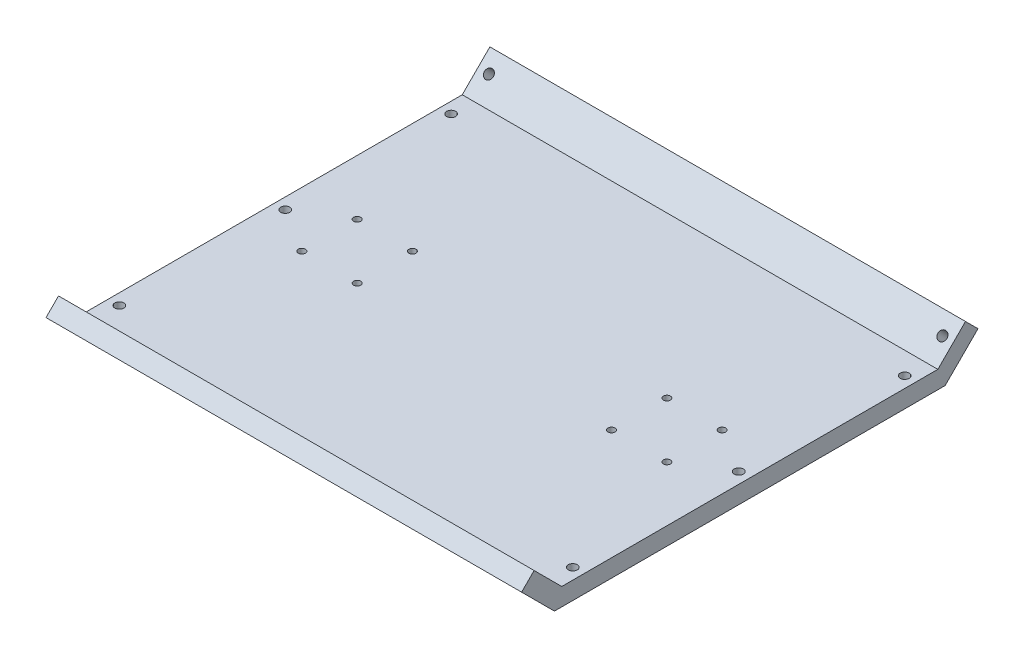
ISO-10303-21;
HEADER;
FILE_DESCRIPTION(('STEP AP214'),'2;1');
FILE_NAME('part.step','',(''),(''),'','','');
FILE_SCHEMA(('AUTOMOTIVE_DESIGN { 1 0 10303 214 1 1 1 1 }'));
ENDSEC;
DATA;
#1=APPLICATION_CONTEXT('core data for automotive mechanical design processes');
#2=APPLICATION_PROTOCOL_DEFINITION('international standard','automotive_design',2000,#1);
#3=PRODUCT_CONTEXT('',#1,'mechanical');
#4=PRODUCT('Part','Part','',(#3));
#5=PRODUCT_RELATED_PRODUCT_CATEGORY('part','',(#4));
#6=PRODUCT_DEFINITION_FORMATION('','',#4);
#7=PRODUCT_DEFINITION_CONTEXT('part definition',#1,'design');
#8=PRODUCT_DEFINITION('design','',#6,#7);
#9=PRODUCT_DEFINITION_SHAPE('','',#8);
#10=(LENGTH_UNIT() NAMED_UNIT(*) SI_UNIT(.MILLI.,.METRE.));
#11=(NAMED_UNIT(*) PLANE_ANGLE_UNIT() SI_UNIT($,.RADIAN.));
#12=(NAMED_UNIT(*) SI_UNIT($,.STERADIAN.) SOLID_ANGLE_UNIT());
#13=UNCERTAINTY_MEASURE_WITH_UNIT(LENGTH_MEASURE(1.E-05),#10,'distance_accuracy_value','');
#14=(GEOMETRIC_REPRESENTATION_CONTEXT(3) GLOBAL_UNCERTAINTY_ASSIGNED_CONTEXT((#13)) GLOBAL_UNIT_ASSIGNED_CONTEXT((#10,
#11,#12)) REPRESENTATION_CONTEXT('',''));
#15=CARTESIAN_POINT('',(0.,0.,0.));
#16=DIRECTION('',(0.,0.,1.));
#17=DIRECTION('',(1.,0.,0.));
#18=AXIS2_PLACEMENT_3D('',#15,#16,#17);
#19=CARTESIAN_POINT('',(107.5,6.84314575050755,103.156854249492));
#20=DIRECTION('',(0.,-0.707106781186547,-0.707106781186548));
#21=DIRECTION('',(0.,0.707106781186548,-0.707106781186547));
#22=AXIS2_PLACEMENT_3D('',#19,#20,#21);
#23=PLANE('',#22);
#24=DIRECTION('',(0.,-0.707106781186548,0.707106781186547));
#25=VECTOR('',#24,1.);
#26=CARTESIAN_POINT('',(-107.5,6.84314575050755,103.156854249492));
#27=LINE('',#26,#25);
#28=CARTESIAN_POINT('',(-107.5,12.4999999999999,97.5000000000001));
#29=VERTEX_POINT('',#28);
#30=CARTESIAN_POINT('',(-107.5,6.84314575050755,103.156854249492));
#31=VERTEX_POINT('',#30);
#32=EDGE_CURVE('E136',#29,#31,#27,.T.);
#33=ORIENTED_EDGE('',*,*,#32,.T.);
#34=DIRECTION('',(-1.,0.,0.));
#35=VECTOR('',#34,1.);
#36=CARTESIAN_POINT('',(107.5,6.84314575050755,103.156854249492));
#37=LINE('',#36,#35);
#38=CARTESIAN_POINT('',(107.5,6.84314575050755,103.156854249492));
#39=VERTEX_POINT('',#38);
#40=EDGE_CURVE('E11',#39,#31,#37,.T.);
#41=ORIENTED_EDGE('',*,*,#40,.F.);
#42=DIRECTION('',(0.,-0.707106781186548,0.707106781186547));
#43=VECTOR('',#42,1.);
#44=CARTESIAN_POINT('',(107.5,6.84314575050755,103.156854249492));
#45=LINE('',#44,#43);
#46=CARTESIAN_POINT('',(107.5,12.4999999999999,97.5000000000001));
#47=VERTEX_POINT('',#46);
#48=EDGE_CURVE('E151',#47,#39,#45,.T.);
#49=ORIENTED_EDGE('',*,*,#48,.F.);
#50=DIRECTION('',(-1.,0.,0.));
#51=VECTOR('',#50,1.);
#52=CARTESIAN_POINT('',(107.5,12.4999999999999,97.5000000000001));
#53=LINE('',#52,#51);
#54=EDGE_CURVE('E132',#47,#29,#53,.T.);
#55=ORIENTED_EDGE('',*,*,#54,.T.);
#56=EDGE_LOOP('',(#33,#41,#49,#55));
#57=FACE_BOUND('',#56,.T.);
#58=ADVANCED_FACE('F38',(#57),#23,.F.);
#59=CARTESIAN_POINT('',(107.5,-8.,88.313708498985));
#60=DIRECTION('',(0.,0.707106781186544,-0.707106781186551));
#61=DIRECTION('',(0.,0.707106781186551,0.707106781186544));
#62=AXIS2_PLACEMENT_3D('',#59,#60,#61);
#63=PLANE('',#62);
#64=CARTESIAN_POINT('',(-102.5,1.41421356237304,97.7279220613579));
#65=DIRECTION('',(0.,0.707106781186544,-0.707106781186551));
#66=DIRECTION('',(0.,0.707106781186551,0.707106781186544));
#67=AXIS2_PLACEMENT_3D('',#64,#65,#66);
#68=CIRCLE('',#67,2.04999999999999);
#69=CARTESIAN_POINT('',(-102.5,2.86378246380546,99.1774909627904));
#70=VERTEX_POINT('',#69);
#71=EDGE_CURVE('E229',#70,#70,#68,.T.);
#72=ORIENTED_EDGE('',*,*,#71,.T.);
#73=EDGE_LOOP('',(#72));
#74=FACE_BOUND('',#73,.T.);
#75=CARTESIAN_POINT('',(102.5,1.41421356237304,97.7279220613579));
#76=DIRECTION('',(0.,0.707106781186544,-0.707106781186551));
#77=DIRECTION('',(0.,0.707106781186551,0.707106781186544));
#78=AXIS2_PLACEMENT_3D('',#75,#76,#77);
#79=CIRCLE('',#78,2.04999999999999);
#80=CARTESIAN_POINT('',(102.5,2.86378246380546,99.1774909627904));
#81=VERTEX_POINT('',#80);
#82=EDGE_CURVE('E235',#81,#81,#79,.T.);
#83=ORIENTED_EDGE('',*,*,#82,.T.);
#84=EDGE_LOOP('',(#83));
#85=FACE_BOUND('',#84,.T.);
#86=DIRECTION('',(0.,-0.707106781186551,-0.707106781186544));
#87=VECTOR('',#86,1.);
#88=CARTESIAN_POINT('',(-107.5,-8.,88.313708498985));
#89=LINE('',#88,#87);
#90=CARTESIAN_POINT('',(-107.5,-8.,88.313708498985));
#91=VERTEX_POINT('',#90);
#92=EDGE_CURVE('E139',#31,#91,#89,.T.);
#93=ORIENTED_EDGE('',*,*,#92,.T.);
#94=DIRECTION('',(-1.,0.,0.));
#95=VECTOR('',#94,1.);
#96=CARTESIAN_POINT('',(107.5,-8.,88.313708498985));
#97=LINE('',#96,#95);
#98=CARTESIAN_POINT('',(107.5,-8.,88.313708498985));
#99=VERTEX_POINT('',#98);
#100=EDGE_CURVE('E47',#99,#91,#97,.T.);
#101=ORIENTED_EDGE('',*,*,#100,.F.);
#102=DIRECTION('',(0.,-0.707106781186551,-0.707106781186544));
#103=VECTOR('',#102,1.);
#104=CARTESIAN_POINT('',(107.5,-8.,88.313708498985));
#105=LINE('',#104,#103);
#106=EDGE_CURVE('E99',#39,#99,#105,.T.);
#107=ORIENTED_EDGE('',*,*,#106,.F.);
#108=ORIENTED_EDGE('',*,*,#40,.T.);
#109=EDGE_LOOP('',(#93,#101,#107,#108));
#110=FACE_BOUND('',#109,.T.);
#111=ADVANCED_FACE('F300',(#74,#85,#110),#63,.F.);
#112=CARTESIAN_POINT('',(107.5,-8.,88.313708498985));
#113=DIRECTION('',(0.,1.,0.));
#114=DIRECTION('',(0.,0.,1.));
#115=AXIS2_PLACEMENT_3D('',#112,#113,#114);
#116=PLANE('',#115);
#117=CARTESIAN_POINT('',(-57.5,-8.,-12.5));
#118=DIRECTION('',(0.,1.,0.));
#119=DIRECTION('',(0.,0.,-1.));
#120=AXIS2_PLACEMENT_3D('',#117,#118,#119);
#121=CIRCLE('',#120,1.59999999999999);
#122=CARTESIAN_POINT('',(-57.5,-8.,-14.1));
#123=VERTEX_POINT('',#122);
#124=EDGE_CURVE('E447',#123,#123,#121,.T.);
#125=ORIENTED_EDGE('',*,*,#124,.T.);
#126=EDGE_LOOP('',(#125));
#127=FACE_BOUND('',#126,.T.);
#128=CARTESIAN_POINT('',(-82.5,-8.,-12.5));
#129=DIRECTION('',(0.,1.,0.));
#130=DIRECTION('',(0.,0.,-1.));
#131=AXIS2_PLACEMENT_3D('',#128,#129,#130);
#132=CIRCLE('',#131,1.59999999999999);
#133=CARTESIAN_POINT('',(-82.5,-8.,-14.1));
#134=VERTEX_POINT('',#133);
#135=EDGE_CURVE('E442',#134,#134,#132,.T.);
#136=ORIENTED_EDGE('',*,*,#135,.T.);
#137=EDGE_LOOP('',(#136));
#138=FACE_BOUND('',#137,.T.);
#139=CARTESIAN_POINT('',(-82.5,-8.,12.5));
#140=DIRECTION('',(0.,1.,0.));
#141=DIRECTION('',(0.,0.,-1.));
#142=AXIS2_PLACEMENT_3D('',#139,#140,#141);
#143=CIRCLE('',#142,1.59999999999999);
#144=CARTESIAN_POINT('',(-82.5,-8.,10.9));
#145=VERTEX_POINT('',#144);
#146=EDGE_CURVE('E405',#145,#145,#143,.T.);
#147=ORIENTED_EDGE('',*,*,#146,.T.);
#148=EDGE_LOOP('',(#147));
#149=FACE_BOUND('',#148,.T.);
#150=CARTESIAN_POINT('',(-57.5,-8.,12.5));
#151=DIRECTION('',(0.,1.,0.));
#152=DIRECTION('',(0.,0.,-1.));
#153=AXIS2_PLACEMENT_3D('',#150,#151,#152);
#154=CIRCLE('',#153,1.59999999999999);
#155=CARTESIAN_POINT('',(-57.5,-8.,10.9));
#156=VERTEX_POINT('',#155);
#157=EDGE_CURVE('E181',#156,#156,#154,.T.);
#158=ORIENTED_EDGE('',*,*,#157,.T.);
#159=EDGE_LOOP('',(#158));
#160=FACE_BOUND('',#159,.T.);
#161=CARTESIAN_POINT('',(57.5,-8.,-12.5));
#162=DIRECTION('',(0.,-1.,0.));
#163=DIRECTION('',(0.,0.,-1.));
#164=AXIS2_PLACEMENT_3D('',#161,#162,#163);
#165=CIRCLE('',#164,1.59999999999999);
#166=CARTESIAN_POINT('',(57.5,-8.,-14.1));
#167=VERTEX_POINT('',#166);
#168=EDGE_CURVE('E188',#167,#167,#165,.T.);
#169=ORIENTED_EDGE('',*,*,#168,.F.);
#170=EDGE_LOOP('',(#169));
#171=FACE_BOUND('',#170,.T.);
#172=CARTESIAN_POINT('',(82.5,-8.,-12.5));
#173=DIRECTION('',(0.,-1.,0.));
#174=DIRECTION('',(0.,0.,-1.));
#175=AXIS2_PLACEMENT_3D('',#172,#173,#174);
#176=CIRCLE('',#175,1.59999999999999);
#177=CARTESIAN_POINT('',(82.5,-8.,-14.1));
#178=VERTEX_POINT('',#177);
#179=EDGE_CURVE('E192',#178,#178,#176,.T.);
#180=ORIENTED_EDGE('',*,*,#179,.F.);
#181=EDGE_LOOP('',(#180));
#182=FACE_BOUND('',#181,.T.);
#183=CARTESIAN_POINT('',(82.5,-8.,12.5));
#184=DIRECTION('',(0.,-1.,0.));
#185=DIRECTION('',(0.,0.,-1.));
#186=AXIS2_PLACEMENT_3D('',#183,#184,#185);
#187=CIRCLE('',#186,1.59999999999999);
#188=CARTESIAN_POINT('',(82.5,-8.,10.9));
#189=VERTEX_POINT('',#188);
#190=EDGE_CURVE('E197',#189,#189,#187,.T.);
#191=ORIENTED_EDGE('',*,*,#190,.F.);
#192=EDGE_LOOP('',(#191));
#193=FACE_BOUND('',#192,.T.);
#194=CARTESIAN_POINT('',(57.5,-8.,12.5));
#195=DIRECTION('',(0.,-1.,0.));
#196=DIRECTION('',(0.,0.,-1.));
#197=AXIS2_PLACEMENT_3D('',#194,#195,#196);
#198=CIRCLE('',#197,1.59999999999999);
#199=CARTESIAN_POINT('',(57.5,-8.,10.9));
#200=VERTEX_POINT('',#199);
#201=EDGE_CURVE('E167',#200,#200,#198,.T.);
#202=ORIENTED_EDGE('',*,*,#201,.F.);
#203=EDGE_LOOP('',(#202));
#204=FACE_BOUND('',#203,.T.);
#205=CARTESIAN_POINT('',(-102.5,-8.,-75.0000000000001));
#206=DIRECTION('',(0.,1.,0.));
#207=DIRECTION('',(0.,0.,1.));
#208=AXIS2_PLACEMENT_3D('',#205,#206,#207);
#209=CIRCLE('',#208,2.05);
#210=CARTESIAN_POINT('',(-102.5,-8.,-72.9500000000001));
#211=VERTEX_POINT('',#210);
#212=EDGE_CURVE('E211',#211,#211,#209,.T.);
#213=ORIENTED_EDGE('',*,*,#212,.T.);
#214=EDGE_LOOP('',(#213));
#215=FACE_BOUND('',#214,.T.);
#216=CARTESIAN_POINT('',(-102.5,-8.,0.));
#217=DIRECTION('',(0.,1.,0.));
#218=DIRECTION('',(0.,0.,1.));
#219=AXIS2_PLACEMENT_3D('',#216,#217,#218);
#220=CIRCLE('',#219,2.05);
#221=CARTESIAN_POINT('',(-102.5,-8.,2.05));
#222=VERTEX_POINT('',#221);
#223=EDGE_CURVE('E217',#222,#222,#220,.T.);
#224=ORIENTED_EDGE('',*,*,#223,.T.);
#225=EDGE_LOOP('',(#224));
#226=FACE_BOUND('',#225,.T.);
#227=CARTESIAN_POINT('',(-102.5,-8.,75.0000000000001));
#228=DIRECTION('',(0.,1.,0.));
#229=DIRECTION('',(0.,0.,1.));
#230=AXIS2_PLACEMENT_3D('',#227,#228,#229);
#231=CIRCLE('',#230,2.05);
#232=CARTESIAN_POINT('',(-102.5,-8.,77.0500000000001));
#233=VERTEX_POINT('',#232);
#234=EDGE_CURVE('E223',#233,#233,#231,.T.);
#235=ORIENTED_EDGE('',*,*,#234,.T.);
#236=EDGE_LOOP('',(#235));
#237=FACE_BOUND('',#236,.T.);
#238=CARTESIAN_POINT('',(102.5,-8.,75.0000000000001));
#239=DIRECTION('',(0.,1.,0.));
#240=DIRECTION('',(0.,0.,1.));
#241=AXIS2_PLACEMENT_3D('',#238,#239,#240);
#242=CIRCLE('',#241,2.05);
#243=CARTESIAN_POINT('',(102.5,-8.,77.0500000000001));
#244=VERTEX_POINT('',#243);
#245=EDGE_CURVE('E241',#244,#244,#242,.T.);
#246=ORIENTED_EDGE('',*,*,#245,.T.);
#247=EDGE_LOOP('',(#246));
#248=FACE_BOUND('',#247,.T.);
#249=CARTESIAN_POINT('',(102.5,-8.,0.));
#250=DIRECTION('',(0.,1.,0.));
#251=DIRECTION('',(0.,0.,1.));
#252=AXIS2_PLACEMENT_3D('',#249,#250,#251);
#253=CIRCLE('',#252,2.05);
#254=CARTESIAN_POINT('',(102.5,-8.,2.05));
#255=VERTEX_POINT('',#254);
#256=EDGE_CURVE('E247',#255,#255,#253,.T.);
#257=ORIENTED_EDGE('',*,*,#256,.T.);
#258=EDGE_LOOP('',(#257));
#259=FACE_BOUND('',#258,.T.);
#260=CARTESIAN_POINT('',(102.5,-8.,-75.0000000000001));
#261=DIRECTION('',(0.,1.,0.));
#262=DIRECTION('',(0.,0.,1.));
#263=AXIS2_PLACEMENT_3D('',#260,#261,#262);
#264=CIRCLE('',#263,2.05);
#265=CARTESIAN_POINT('',(102.5,-8.,-72.9500000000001));
#266=VERTEX_POINT('',#265);
#267=EDGE_CURVE('E253',#266,#266,#264,.T.);
#268=ORIENTED_EDGE('',*,*,#267,.T.);
#269=EDGE_LOOP('',(#268));
#270=FACE_BOUND('',#269,.T.);
#271=DIRECTION('',(0.,0.,-1.));
#272=VECTOR('',#271,1.);
#273=CARTESIAN_POINT('',(-107.5,-8.,88.313708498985));
#274=LINE('',#273,#272);
#275=CARTESIAN_POINT('',(-107.5,-8.,-88.3137084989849));
#276=VERTEX_POINT('',#275);
#277=EDGE_CURVE('E142',#91,#276,#274,.T.);
#278=ORIENTED_EDGE('',*,*,#277,.T.);
#279=DIRECTION('',(-1.,0.,0.));
#280=VECTOR('',#279,1.);
#281=CARTESIAN_POINT('',(107.5,-8.,-88.3137084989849));
#282=LINE('',#281,#280);
#283=CARTESIAN_POINT('',(107.5,-8.,-88.3137084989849));
#284=VERTEX_POINT('',#283);
#285=EDGE_CURVE('E158',#284,#276,#282,.T.);
#286=ORIENTED_EDGE('',*,*,#285,.F.);
#287=DIRECTION('',(0.,0.,-1.));
#288=VECTOR('',#287,1.);
#289=CARTESIAN_POINT('',(107.5,-8.,88.313708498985));
#290=LINE('',#289,#288);
#291=EDGE_CURVE('E263',#99,#284,#290,.T.);
#292=ORIENTED_EDGE('',*,*,#291,.F.);
#293=ORIENTED_EDGE('',*,*,#100,.T.);
#294=EDGE_LOOP('',(#278,#286,#292,#293));
#295=FACE_BOUND('',#294,.T.);
#296=ADVANCED_FACE('F305',(#127,#138,#149,#160,#171,#182,#193,#204,#215,#226,#237,#248,#259,
#270,#295),#116,.F.);
#297=CARTESIAN_POINT('',(107.5,-8.,-88.3137084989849));
#298=DIRECTION('',(0.,0.707106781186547,0.707106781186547));
#299=DIRECTION('',(0.,-0.707106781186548,0.707106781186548));
#300=AXIS2_PLACEMENT_3D('',#297,#298,#299);
#301=PLANE('',#300);
#302=CARTESIAN_POINT('',(-102.5,1.4142135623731,-97.727922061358));
#303=DIRECTION('',(0.,0.707106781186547,0.707106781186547));
#304=DIRECTION('',(0.,-0.707106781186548,0.707106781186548));
#305=AXIS2_PLACEMENT_3D('',#302,#303,#304);
#306=CIRCLE('',#305,2.04999999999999);
#307=CARTESIAN_POINT('',(-102.5,-0.0353553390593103,-96.2783531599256));
#308=VERTEX_POINT('',#307);
#309=EDGE_CURVE('E205',#308,#308,#306,.T.);
#310=ORIENTED_EDGE('',*,*,#309,.T.);
#311=EDGE_LOOP('',(#310));
#312=FACE_BOUND('',#311,.T.);
#313=CARTESIAN_POINT('',(102.5,1.4142135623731,-97.727922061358));
#314=DIRECTION('',(0.,0.707106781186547,0.707106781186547));
#315=DIRECTION('',(0.,-0.707106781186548,0.707106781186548));
#316=AXIS2_PLACEMENT_3D('',#313,#314,#315);
#317=CIRCLE('',#316,2.04999999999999);
#318=CARTESIAN_POINT('',(102.5,-0.0353553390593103,-96.2783531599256));
#319=VERTEX_POINT('',#318);
#320=EDGE_CURVE('E140',#319,#319,#317,.T.);
#321=ORIENTED_EDGE('',*,*,#320,.T.);
#322=EDGE_LOOP('',(#321));
#323=FACE_BOUND('',#322,.T.);
#324=DIRECTION('',(0.,0.707106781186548,-0.707106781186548));
#325=VECTOR('',#324,1.);
#326=CARTESIAN_POINT('',(-107.5,-8.,-88.3137084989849));
#327=LINE('',#326,#325);
#328=CARTESIAN_POINT('',(-107.5,6.84314575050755,-103.156854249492));
#329=VERTEX_POINT('',#328);
#330=EDGE_CURVE('E144',#276,#329,#327,.T.);
#331=ORIENTED_EDGE('',*,*,#330,.T.);
#332=DIRECTION('',(-1.,0.,0.));
#333=VECTOR('',#332,1.);
#334=CARTESIAN_POINT('',(107.5,6.84314575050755,-103.156854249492));
#335=LINE('',#334,#333);
#336=CARTESIAN_POINT('',(107.5,6.84314575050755,-103.156854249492));
#337=VERTEX_POINT('',#336);
#338=EDGE_CURVE('E155',#337,#329,#335,.T.);
#339=ORIENTED_EDGE('',*,*,#338,.F.);
#340=DIRECTION('',(0.,0.707106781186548,-0.707106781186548));
#341=VECTOR('',#340,1.);
#342=CARTESIAN_POINT('',(107.5,-8.,-88.3137084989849));
#343=LINE('',#342,#341);
#344=EDGE_CURVE('E265',#284,#337,#343,.T.);
#345=ORIENTED_EDGE('',*,*,#344,.F.);
#346=ORIENTED_EDGE('',*,*,#285,.T.);
#347=EDGE_LOOP('',(#331,#339,#345,#346));
#348=FACE_BOUND('',#347,.T.);
#349=ADVANCED_FACE('F271',(#312,#323,#348),#301,.F.);
#350=CARTESIAN_POINT('',(107.5,12.5,-97.5));
#351=DIRECTION('',(0.,-0.707106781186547,0.707106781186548));
#352=DIRECTION('',(0.,-0.707106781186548,-0.707106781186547));
#353=AXIS2_PLACEMENT_3D('',#350,#351,#352);
#354=PLANE('',#353);
#355=DIRECTION('',(0.,0.707106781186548,0.707106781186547));
#356=VECTOR('',#355,1.);
#357=CARTESIAN_POINT('',(-107.5,12.5,-97.5));
#358=LINE('',#357,#356);
#359=CARTESIAN_POINT('',(-107.5,12.5,-97.5));
#360=VERTEX_POINT('',#359);
#361=EDGE_CURVE('E146',#329,#360,#358,.T.);
#362=ORIENTED_EDGE('',*,*,#361,.T.);
#363=DIRECTION('',(-1.,0.,0.));
#364=VECTOR('',#363,1.);
#365=CARTESIAN_POINT('',(107.5,12.5,-97.5));
#366=LINE('',#365,#364);
#367=CARTESIAN_POINT('',(107.5,12.5,-97.5));
#368=VERTEX_POINT('',#367);
#369=EDGE_CURVE('E127',#368,#360,#366,.T.);
#370=ORIENTED_EDGE('',*,*,#369,.F.);
#371=DIRECTION('',(0.,0.707106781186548,0.707106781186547));
#372=VECTOR('',#371,1.);
#373=CARTESIAN_POINT('',(107.5,12.5,-97.5));
#374=LINE('',#373,#372);
#375=EDGE_CURVE('E118',#337,#368,#374,.T.);
#376=ORIENTED_EDGE('',*,*,#375,.F.);
#377=ORIENTED_EDGE('',*,*,#338,.T.);
#378=EDGE_LOOP('',(#362,#370,#376,#377));
#379=FACE_BOUND('',#378,.T.);
#380=ADVANCED_FACE('F275',(#379),#354,.F.);
#381=CARTESIAN_POINT('',(107.5,0.,-85.0000000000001));
#382=DIRECTION('',(0.,-0.707106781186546,-0.707106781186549));
#383=DIRECTION('',(0.,0.707106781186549,-0.707106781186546));
#384=AXIS2_PLACEMENT_3D('',#381,#382,#383);
#385=PLANE('',#384);
#386=CARTESIAN_POINT('',(-102.5,7.07106781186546,-92.0710678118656));
#387=DIRECTION('',(0.,0.707106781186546,0.707106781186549));
#388=DIRECTION('',(0.,-0.707106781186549,0.707106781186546));
#389=AXIS2_PLACEMENT_3D('',#386,#387,#388);
#390=CIRCLE('',#389,2.04999999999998);
#391=CARTESIAN_POINT('',(-102.5,5.62149891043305,-90.6214989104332));
#392=VERTEX_POINT('',#391);
#393=EDGE_CURVE('E176',#392,#392,#390,.T.);
#394=ORIENTED_EDGE('',*,*,#393,.F.);
#395=EDGE_LOOP('',(#394));
#396=FACE_BOUND('',#395,.T.);
#397=CARTESIAN_POINT('',(102.5,7.07106781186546,-92.0710678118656));
#398=DIRECTION('',(0.,0.707106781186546,0.707106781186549));
#399=DIRECTION('',(0.,-0.707106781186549,0.707106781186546));
#400=AXIS2_PLACEMENT_3D('',#397,#398,#399);
#401=CIRCLE('',#400,2.04999999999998);
#402=CARTESIAN_POINT('',(102.5,5.62149891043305,-90.6214989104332));
#403=VERTEX_POINT('',#402);
#404=EDGE_CURVE('E256',#403,#403,#401,.T.);
#405=ORIENTED_EDGE('',*,*,#404,.F.);
#406=EDGE_LOOP('',(#405));
#407=FACE_BOUND('',#406,.T.);
#408=DIRECTION('',(0.,-0.707106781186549,0.707106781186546));
#409=VECTOR('',#408,1.);
#410=CARTESIAN_POINT('',(-107.5,0.,-85.0000000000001));
#411=LINE('',#410,#409);
#412=CARTESIAN_POINT('',(-107.5,0.,-85.0000000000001));
#413=VERTEX_POINT('',#412);
#414=EDGE_CURVE('E126',#360,#413,#411,.T.);
#415=ORIENTED_EDGE('',*,*,#414,.T.);
#416=DIRECTION('',(-1.,0.,0.));
#417=VECTOR('',#416,1.);
#418=CARTESIAN_POINT('',(107.5,0.,-85.0000000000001));
#419=LINE('',#418,#417);
#420=CARTESIAN_POINT('',(107.5,0.,-85.0000000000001));
#421=VERTEX_POINT('',#420);
#422=EDGE_CURVE('E123',#421,#413,#419,.T.);
#423=ORIENTED_EDGE('',*,*,#422,.F.);
#424=DIRECTION('',(0.,-0.707106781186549,0.707106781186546));
#425=VECTOR('',#424,1.);
#426=CARTESIAN_POINT('',(107.5,0.,-85.0000000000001));
#427=LINE('',#426,#425);
#428=EDGE_CURVE('E112',#368,#421,#427,.T.);
#429=ORIENTED_EDGE('',*,*,#428,.F.);
#430=ORIENTED_EDGE('',*,*,#369,.T.);
#431=EDGE_LOOP('',(#415,#423,#429,#430));
#432=FACE_BOUND('',#431,.T.);
#433=ADVANCED_FACE('F124',(#396,#407,#432),#385,.F.);
#434=CARTESIAN_POINT('',(107.5,0.,85.0000000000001));
#435=DIRECTION('',(0.,-1.,0.));
#436=DIRECTION('',(0.,0.,-1.));
#437=AXIS2_PLACEMENT_3D('',#434,#435,#436);
#438=PLANE('',#437);
#439=CARTESIAN_POINT('',(-57.5,0.,-12.5));
#440=DIRECTION('',(0.,-1.,0.));
#441=DIRECTION('',(0.,0.,-1.));
#442=AXIS2_PLACEMENT_3D('',#439,#440,#441);
#443=CIRCLE('',#442,1.59999999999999);
#444=CARTESIAN_POINT('',(-57.5,0.,-14.1));
#445=VERTEX_POINT('',#444);
#446=EDGE_CURVE('E41',#445,#445,#443,.F.);
#447=ORIENTED_EDGE('',*,*,#446,.F.);
#448=EDGE_LOOP('',(#447));
#449=FACE_BOUND('',#448,.T.);
#450=CARTESIAN_POINT('',(-82.5,0.,-12.5));
#451=DIRECTION('',(0.,-1.,0.));
#452=DIRECTION('',(0.,0.,-1.));
#453=AXIS2_PLACEMENT_3D('',#450,#451,#452);
#454=CIRCLE('',#453,1.59999999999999);
#455=CARTESIAN_POINT('',(-82.5,0.,-14.1));
#456=VERTEX_POINT('',#455);
#457=EDGE_CURVE('E183',#456,#456,#454,.F.);
#458=ORIENTED_EDGE('',*,*,#457,.F.);
#459=EDGE_LOOP('',(#458));
#460=FACE_BOUND('',#459,.T.);
#461=CARTESIAN_POINT('',(-82.5,0.,12.5));
#462=DIRECTION('',(0.,-1.,0.));
#463=DIRECTION('',(0.,0.,-1.));
#464=AXIS2_PLACEMENT_3D('',#461,#462,#463);
#465=CIRCLE('',#464,1.59999999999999);
#466=CARTESIAN_POINT('',(-82.5,0.,10.9));
#467=VERTEX_POINT('',#466);
#468=EDGE_CURVE('E180',#467,#467,#465,.F.);
#469=ORIENTED_EDGE('',*,*,#468,.F.);
#470=EDGE_LOOP('',(#469));
#471=FACE_BOUND('',#470,.T.);
#472=CARTESIAN_POINT('',(-57.5,0.,12.5));
#473=DIRECTION('',(0.,-1.,0.));
#474=DIRECTION('',(0.,0.,-1.));
#475=AXIS2_PLACEMENT_3D('',#472,#473,#474);
#476=CIRCLE('',#475,1.59999999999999);
#477=CARTESIAN_POINT('',(-57.5,0.,10.9));
#478=VERTEX_POINT('',#477);
#479=EDGE_CURVE('E177',#478,#478,#476,.F.);
#480=ORIENTED_EDGE('',*,*,#479,.F.);
#481=EDGE_LOOP('',(#480));
#482=FACE_BOUND('',#481,.T.);
#483=CARTESIAN_POINT('',(57.5,0.,-12.5));
#484=DIRECTION('',(0.,-1.,0.));
#485=DIRECTION('',(0.,0.,-1.));
#486=AXIS2_PLACEMENT_3D('',#483,#484,#485);
#487=CIRCLE('',#486,1.59999999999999);
#488=CARTESIAN_POINT('',(57.5,0.,-14.1));
#489=VERTEX_POINT('',#488);
#490=EDGE_CURVE('E173',#489,#489,#487,.T.);
#491=ORIENTED_EDGE('',*,*,#490,.T.);
#492=EDGE_LOOP('',(#491));
#493=FACE_BOUND('',#492,.T.);
#494=CARTESIAN_POINT('',(82.5,0.,-12.5));
#495=DIRECTION('',(0.,-1.,0.));
#496=DIRECTION('',(0.,0.,-1.));
#497=AXIS2_PLACEMENT_3D('',#494,#495,#496);
#498=CIRCLE('',#497,1.59999999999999);
#499=CARTESIAN_POINT('',(82.5,0.,-14.1));
#500=VERTEX_POINT('',#499);
#501=EDGE_CURVE('E170',#500,#500,#498,.T.);
#502=ORIENTED_EDGE('',*,*,#501,.T.);
#503=EDGE_LOOP('',(#502));
#504=FACE_BOUND('',#503,.T.);
#505=CARTESIAN_POINT('',(82.5,0.,12.5));
#506=DIRECTION('',(0.,-1.,0.));
#507=DIRECTION('',(0.,0.,-1.));
#508=AXIS2_PLACEMENT_3D('',#505,#506,#507);
#509=CIRCLE('',#508,1.59999999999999);
#510=CARTESIAN_POINT('',(82.5,0.,10.9));
#511=VERTEX_POINT('',#510);
#512=EDGE_CURVE('E166',#511,#511,#509,.T.);
#513=ORIENTED_EDGE('',*,*,#512,.T.);
#514=EDGE_LOOP('',(#513));
#515=FACE_BOUND('',#514,.T.);
#516=CARTESIAN_POINT('',(57.5,0.,12.5));
#517=DIRECTION('',(0.,-1.,0.));
#518=DIRECTION('',(0.,0.,-1.));
#519=AXIS2_PLACEMENT_3D('',#516,#517,#518);
#520=CIRCLE('',#519,1.59999999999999);
#521=CARTESIAN_POINT('',(57.5,0.,10.9));
#522=VERTEX_POINT('',#521);
#523=EDGE_CURVE('E163',#522,#522,#520,.T.);
#524=ORIENTED_EDGE('',*,*,#523,.T.);
#525=EDGE_LOOP('',(#524));
#526=FACE_BOUND('',#525,.T.);
#527=CARTESIAN_POINT('',(-102.5,0.,-75.0000000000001));
#528=DIRECTION('',(0.,1.,0.));
#529=DIRECTION('',(0.,0.,1.));
#530=AXIS2_PLACEMENT_3D('',#527,#528,#529);
#531=CIRCLE('',#530,2.04999999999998);
#532=CARTESIAN_POINT('',(-102.5,0.,-72.9500000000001));
#533=VERTEX_POINT('',#532);
#534=EDGE_CURVE('E208',#533,#533,#531,.T.);
#535=ORIENTED_EDGE('',*,*,#534,.F.);
#536=EDGE_LOOP('',(#535));
#537=FACE_BOUND('',#536,.T.);
#538=CARTESIAN_POINT('',(-102.5,0.,0.));
#539=DIRECTION('',(0.,1.,0.));
#540=DIRECTION('',(0.,0.,1.));
#541=AXIS2_PLACEMENT_3D('',#538,#539,#540);
#542=CIRCLE('',#541,2.04999999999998);
#543=CARTESIAN_POINT('',(-102.5,0.,2.04999999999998));
#544=VERTEX_POINT('',#543);
#545=EDGE_CURVE('E214',#544,#544,#542,.T.);
#546=ORIENTED_EDGE('',*,*,#545,.F.);
#547=EDGE_LOOP('',(#546));
#548=FACE_BOUND('',#547,.T.);
#549=CARTESIAN_POINT('',(-102.5,0.,75.0000000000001));
#550=DIRECTION('',(0.,1.,0.));
#551=DIRECTION('',(0.,0.,1.));
#552=AXIS2_PLACEMENT_3D('',#549,#550,#551);
#553=CIRCLE('',#552,2.04999999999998);
#554=CARTESIAN_POINT('',(-102.5,0.,77.0500000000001));
#555=VERTEX_POINT('',#554);
#556=EDGE_CURVE('E220',#555,#555,#553,.T.);
#557=ORIENTED_EDGE('',*,*,#556,.F.);
#558=EDGE_LOOP('',(#557));
#559=FACE_BOUND('',#558,.T.);
#560=CARTESIAN_POINT('',(102.5,0.,75.0000000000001));
#561=DIRECTION('',(0.,1.,0.));
#562=DIRECTION('',(0.,0.,1.));
#563=AXIS2_PLACEMENT_3D('',#560,#561,#562);
#564=CIRCLE('',#563,2.04999999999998);
#565=CARTESIAN_POINT('',(102.5,0.,77.0500000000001));
#566=VERTEX_POINT('',#565);
#567=EDGE_CURVE('E238',#566,#566,#564,.T.);
#568=ORIENTED_EDGE('',*,*,#567,.F.);
#569=EDGE_LOOP('',(#568));
#570=FACE_BOUND('',#569,.T.);
#571=CARTESIAN_POINT('',(102.5,0.,0.));
#572=DIRECTION('',(0.,1.,0.));
#573=DIRECTION('',(0.,0.,1.));
#574=AXIS2_PLACEMENT_3D('',#571,#572,#573);
#575=CIRCLE('',#574,2.04999999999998);
#576=CARTESIAN_POINT('',(102.5,0.,2.04999999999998));
#577=VERTEX_POINT('',#576);
#578=EDGE_CURVE('E244',#577,#577,#575,.T.);
#579=ORIENTED_EDGE('',*,*,#578,.F.);
#580=EDGE_LOOP('',(#579));
#581=FACE_BOUND('',#580,.T.);
#582=CARTESIAN_POINT('',(102.5,0.,-75.0000000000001));
#583=DIRECTION('',(0.,1.,0.));
#584=DIRECTION('',(0.,0.,1.));
#585=AXIS2_PLACEMENT_3D('',#582,#583,#584);
#586=CIRCLE('',#585,2.04999999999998);
#587=CARTESIAN_POINT('',(102.5,0.,-72.9500000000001));
#588=VERTEX_POINT('',#587);
#589=EDGE_CURVE('E250',#588,#588,#586,.T.);
#590=ORIENTED_EDGE('',*,*,#589,.F.);
#591=EDGE_LOOP('',(#590));
#592=FACE_BOUND('',#591,.T.);
#593=DIRECTION('',(0.,0.,1.));
#594=VECTOR('',#593,1.);
#595=CARTESIAN_POINT('',(-107.5,0.,85.0000000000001));
#596=LINE('',#595,#594);
#597=CARTESIAN_POINT('',(-107.5,0.,85.0000000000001));
#598=VERTEX_POINT('',#597);
#599=EDGE_CURVE('E85',#413,#598,#596,.T.);
#600=ORIENTED_EDGE('',*,*,#599,.T.);
#601=DIRECTION('',(-1.,0.,0.));
#602=VECTOR('',#601,1.);
#603=CARTESIAN_POINT('',(107.5,0.,85.0000000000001));
#604=LINE('',#603,#602);
#605=CARTESIAN_POINT('',(107.5,0.,85.0000000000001));
#606=VERTEX_POINT('',#605);
#607=EDGE_CURVE('E128',#606,#598,#604,.T.);
#608=ORIENTED_EDGE('',*,*,#607,.F.);
#609=DIRECTION('',(0.,0.,1.));
#610=VECTOR('',#609,1.);
#611=CARTESIAN_POINT('',(107.5,0.,85.0000000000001));
#612=LINE('',#611,#610);
#613=EDGE_CURVE('E116',#421,#606,#612,.T.);
#614=ORIENTED_EDGE('',*,*,#613,.F.);
#615=ORIENTED_EDGE('',*,*,#422,.T.);
#616=EDGE_LOOP('',(#600,#608,#614,#615));
#617=FACE_BOUND('',#616,.T.);
#618=ADVANCED_FACE('F130',(#449,#460,#471,#482,#493,#504,#515,#526,#537,#548,#559,#570,#581,
#592,#617),#438,.F.);
#619=CARTESIAN_POINT('',(107.5,0.,85.0000000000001));
#620=DIRECTION('',(0.,-0.707106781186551,0.707106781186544));
#621=DIRECTION('',(0.,-0.707106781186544,-0.707106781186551));
#622=AXIS2_PLACEMENT_3D('',#619,#620,#621);
#623=PLANE('',#622);
#624=CARTESIAN_POINT('',(-102.5,7.07106781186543,92.0710678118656));
#625=DIRECTION('',(0.,0.707106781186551,-0.707106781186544));
#626=DIRECTION('',(0.,0.707106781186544,0.707106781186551));
#627=AXIS2_PLACEMENT_3D('',#624,#625,#626);
#628=CIRCLE('',#627,2.04999999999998);
#629=CARTESIAN_POINT('',(-102.5,8.52063671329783,93.520636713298));
#630=VERTEX_POINT('',#629);
#631=EDGE_CURVE('E226',#630,#630,#628,.T.);
#632=ORIENTED_EDGE('',*,*,#631,.F.);
#633=EDGE_LOOP('',(#632));
#634=FACE_BOUND('',#633,.T.);
#635=CARTESIAN_POINT('',(102.5,7.07106781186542,92.0710678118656));
#636=DIRECTION('',(0.,0.707106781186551,-0.707106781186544));
#637=DIRECTION('',(0.,0.707106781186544,0.707106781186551));
#638=AXIS2_PLACEMENT_3D('',#635,#636,#637);
#639=CIRCLE('',#638,2.04999999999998);
#640=CARTESIAN_POINT('',(102.5,8.52063671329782,93.520636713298));
#641=VERTEX_POINT('',#640);
#642=EDGE_CURVE('E232',#641,#641,#639,.T.);
#643=ORIENTED_EDGE('',*,*,#642,.F.);
#644=EDGE_LOOP('',(#643));
#645=FACE_BOUND('',#644,.T.);
#646=DIRECTION('',(0.,0.707106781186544,0.707106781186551));
#647=VECTOR('',#646,1.);
#648=CARTESIAN_POINT('',(-107.5,0.,85.0000000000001));
#649=LINE('',#648,#647);
#650=EDGE_CURVE('E91',#598,#29,#649,.T.);
#651=ORIENTED_EDGE('',*,*,#650,.T.);
#652=ORIENTED_EDGE('',*,*,#54,.F.);
#653=DIRECTION('',(0.,0.707106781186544,0.707106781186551));
#654=VECTOR('',#653,1.);
#655=CARTESIAN_POINT('',(107.5,0.,85.0000000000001));
#656=LINE('',#655,#654);
#657=EDGE_CURVE('E56',#606,#47,#656,.T.);
#658=ORIENTED_EDGE('',*,*,#657,.F.);
#659=ORIENTED_EDGE('',*,*,#607,.T.);
#660=EDGE_LOOP('',(#651,#652,#658,#659));
#661=FACE_BOUND('',#660,.T.);
#662=ADVANCED_FACE('F283',(#634,#645,#661),#623,.F.);
#663=CARTESIAN_POINT('',(107.5,0.,0.));
#664=DIRECTION('',(1.,0.,0.));
#665=DIRECTION('',(0.,0.,-1.));
#666=AXIS2_PLACEMENT_3D('',#663,#664,#665);
#667=PLANE('',#666);
#668=ORIENTED_EDGE('',*,*,#48,.T.);
#669=ORIENTED_EDGE('',*,*,#106,.T.);
#670=ORIENTED_EDGE('',*,*,#291,.T.);
#671=ORIENTED_EDGE('',*,*,#344,.T.);
#672=ORIENTED_EDGE('',*,*,#375,.T.);
#673=ORIENTED_EDGE('',*,*,#428,.T.);
#674=ORIENTED_EDGE('',*,*,#613,.T.);
#675=ORIENTED_EDGE('',*,*,#657,.T.);
#676=EDGE_LOOP('',(#668,#669,#670,#671,#672,#673,#674,#675));
#677=FACE_BOUND('',#676,.T.);
#678=ADVANCED_FACE('F114',(#677),#667,.T.);
#679=CARTESIAN_POINT('',(-107.5,0.,0.));
#680=DIRECTION('',(1.,0.,0.));
#681=DIRECTION('',(0.,0.,-1.));
#682=AXIS2_PLACEMENT_3D('',#679,#680,#681);
#683=PLANE('',#682);
#684=ORIENTED_EDGE('',*,*,#32,.F.);
#685=ORIENTED_EDGE('',*,*,#650,.F.);
#686=ORIENTED_EDGE('',*,*,#599,.F.);
#687=ORIENTED_EDGE('',*,*,#414,.F.);
#688=ORIENTED_EDGE('',*,*,#361,.F.);
#689=ORIENTED_EDGE('',*,*,#330,.F.);
#690=ORIENTED_EDGE('',*,*,#277,.F.);
#691=ORIENTED_EDGE('',*,*,#92,.F.);
#692=EDGE_LOOP('',(#684,#685,#686,#687,#688,#689,#690,#691));
#693=FACE_BOUND('',#692,.T.);
#694=ADVANCED_FACE('F278',(#693),#683,.F.);
#695=CARTESIAN_POINT('',(102.5,7.07106781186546,-92.0710678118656));
#696=DIRECTION('',(0.,0.707106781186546,0.707106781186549));
#697=DIRECTION('',(0.,-0.707106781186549,0.707106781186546));
#698=AXIS2_PLACEMENT_3D('',#695,#696,#697);
#699=CYLINDRICAL_SURFACE('',#698,2.04999999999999);
#700=ORIENTED_EDGE('',*,*,#404,.T.);
#701=EDGE_LOOP('',(#700));
#702=FACE_BOUND('',#701,.T.);
#703=ORIENTED_EDGE('',*,*,#320,.F.);
#704=EDGE_LOOP('',(#703));
#705=FACE_BOUND('',#704,.T.);
#706=ADVANCED_FACE('F326',(#702,#705),#699,.F.);
#707=CARTESIAN_POINT('',(102.5,0.,-75.0000000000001));
#708=DIRECTION('',(0.,1.,0.));
#709=DIRECTION('',(0.,0.,1.));
#710=AXIS2_PLACEMENT_3D('',#707,#708,#709);
#711=CYLINDRICAL_SURFACE('',#710,2.04999999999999);
#712=ORIENTED_EDGE('',*,*,#267,.F.);
#713=EDGE_LOOP('',(#712));
#714=FACE_BOUND('',#713,.T.);
#715=ORIENTED_EDGE('',*,*,#589,.T.);
#716=EDGE_LOOP('',(#715));
#717=FACE_BOUND('',#716,.T.);
#718=ADVANCED_FACE('F328',(#714,#717),#711,.F.);
#719=CARTESIAN_POINT('',(102.5,0.,0.));
#720=DIRECTION('',(0.,1.,0.));
#721=DIRECTION('',(0.,0.,1.));
#722=AXIS2_PLACEMENT_3D('',#719,#720,#721);
#723=CYLINDRICAL_SURFACE('',#722,2.04999999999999);
#724=ORIENTED_EDGE('',*,*,#256,.F.);
#725=EDGE_LOOP('',(#724));
#726=FACE_BOUND('',#725,.T.);
#727=ORIENTED_EDGE('',*,*,#578,.T.);
#728=EDGE_LOOP('',(#727));
#729=FACE_BOUND('',#728,.T.);
#730=ADVANCED_FACE('F335',(#726,#729),#723,.F.);
#731=CARTESIAN_POINT('',(102.5,0.,75.0000000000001));
#732=DIRECTION('',(0.,1.,0.));
#733=DIRECTION('',(0.,0.,1.));
#734=AXIS2_PLACEMENT_3D('',#731,#732,#733);
#735=CYLINDRICAL_SURFACE('',#734,2.04999999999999);
#736=ORIENTED_EDGE('',*,*,#245,.F.);
#737=EDGE_LOOP('',(#736));
#738=FACE_BOUND('',#737,.T.);
#739=ORIENTED_EDGE('',*,*,#567,.T.);
#740=EDGE_LOOP('',(#739));
#741=FACE_BOUND('',#740,.T.);
#742=ADVANCED_FACE('F341',(#738,#741),#735,.F.);
#743=CARTESIAN_POINT('',(102.5,7.07106781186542,92.0710678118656));
#744=DIRECTION('',(0.,0.707106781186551,-0.707106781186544));
#745=DIRECTION('',(0.,0.707106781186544,0.707106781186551));
#746=AXIS2_PLACEMENT_3D('',#743,#744,#745);
#747=CYLINDRICAL_SURFACE('',#746,2.04999999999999);
#748=ORIENTED_EDGE('',*,*,#642,.T.);
#749=EDGE_LOOP('',(#748));
#750=FACE_BOUND('',#749,.T.);
#751=ORIENTED_EDGE('',*,*,#82,.F.);
#752=EDGE_LOOP('',(#751));
#753=FACE_BOUND('',#752,.T.);
#754=ADVANCED_FACE('F345',(#750,#753),#747,.F.);
#755=CARTESIAN_POINT('',(-102.5,7.07106781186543,92.0710678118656));
#756=DIRECTION('',(0.,0.707106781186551,-0.707106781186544));
#757=DIRECTION('',(0.,0.707106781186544,0.707106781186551));
#758=AXIS2_PLACEMENT_3D('',#755,#756,#757);
#759=CYLINDRICAL_SURFACE('',#758,2.04999999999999);
#760=ORIENTED_EDGE('',*,*,#631,.T.);
#761=EDGE_LOOP('',(#760));
#762=FACE_BOUND('',#761,.T.);
#763=ORIENTED_EDGE('',*,*,#71,.F.);
#764=EDGE_LOOP('',(#763));
#765=FACE_BOUND('',#764,.T.);
#766=ADVANCED_FACE('F349',(#762,#765),#759,.F.);
#767=CARTESIAN_POINT('',(-102.5,0.,75.0000000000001));
#768=DIRECTION('',(0.,1.,0.));
#769=DIRECTION('',(0.,0.,1.));
#770=AXIS2_PLACEMENT_3D('',#767,#768,#769);
#771=CYLINDRICAL_SURFACE('',#770,2.04999999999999);
#772=ORIENTED_EDGE('',*,*,#234,.F.);
#773=EDGE_LOOP('',(#772));
#774=FACE_BOUND('',#773,.T.);
#775=ORIENTED_EDGE('',*,*,#556,.T.);
#776=EDGE_LOOP('',(#775));
#777=FACE_BOUND('',#776,.T.);
#778=ADVANCED_FACE('F353',(#774,#777),#771,.F.);
#779=CARTESIAN_POINT('',(-102.5,0.,0.));
#780=DIRECTION('',(0.,1.,0.));
#781=DIRECTION('',(0.,0.,1.));
#782=AXIS2_PLACEMENT_3D('',#779,#780,#781);
#783=CYLINDRICAL_SURFACE('',#782,2.04999999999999);
#784=ORIENTED_EDGE('',*,*,#223,.F.);
#785=EDGE_LOOP('',(#784));
#786=FACE_BOUND('',#785,.T.);
#787=ORIENTED_EDGE('',*,*,#545,.T.);
#788=EDGE_LOOP('',(#787));
#789=FACE_BOUND('',#788,.T.);
#790=ADVANCED_FACE('F357',(#786,#789),#783,.F.);
#791=CARTESIAN_POINT('',(-102.5,0.,-75.0000000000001));
#792=DIRECTION('',(0.,1.,0.));
#793=DIRECTION('',(0.,0.,1.));
#794=AXIS2_PLACEMENT_3D('',#791,#792,#793);
#795=CYLINDRICAL_SURFACE('',#794,2.04999999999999);
#796=ORIENTED_EDGE('',*,*,#212,.F.);
#797=EDGE_LOOP('',(#796));
#798=FACE_BOUND('',#797,.T.);
#799=ORIENTED_EDGE('',*,*,#534,.T.);
#800=EDGE_LOOP('',(#799));
#801=FACE_BOUND('',#800,.T.);
#802=ADVANCED_FACE('F361',(#798,#801),#795,.F.);
#803=CARTESIAN_POINT('',(-102.5,7.07106781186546,-92.0710678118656));
#804=DIRECTION('',(0.,0.707106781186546,0.707106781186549));
#805=DIRECTION('',(0.,-0.707106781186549,0.707106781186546));
#806=AXIS2_PLACEMENT_3D('',#803,#804,#805);
#807=CYLINDRICAL_SURFACE('',#806,2.04999999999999);
#808=ORIENTED_EDGE('',*,*,#393,.T.);
#809=EDGE_LOOP('',(#808));
#810=FACE_BOUND('',#809,.T.);
#811=ORIENTED_EDGE('',*,*,#309,.F.);
#812=EDGE_LOOP('',(#811));
#813=FACE_BOUND('',#812,.T.);
#814=ADVANCED_FACE('F365',(#810,#813),#807,.F.);
#815=CARTESIAN_POINT('',(57.5,12.5,12.5));
#816=DIRECTION('',(0.,-1.,0.));
#817=DIRECTION('',(0.,0.,-1.));
#818=AXIS2_PLACEMENT_3D('',#815,#816,#817);
#819=CYLINDRICAL_SURFACE('',#818,1.59999999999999);
#820=ORIENTED_EDGE('',*,*,#201,.T.);
#821=EDGE_LOOP('',(#820));
#822=FACE_BOUND('',#821,.T.);
#823=ORIENTED_EDGE('',*,*,#523,.F.);
#824=EDGE_LOOP('',(#823));
#825=FACE_BOUND('',#824,.T.);
#826=ADVANCED_FACE('F369',(#822,#825),#819,.F.);
#827=CARTESIAN_POINT('',(82.5,12.5,12.5));
#828=DIRECTION('',(0.,-1.,0.));
#829=DIRECTION('',(0.,0.,-1.));
#830=AXIS2_PLACEMENT_3D('',#827,#828,#829);
#831=CYLINDRICAL_SURFACE('',#830,1.59999999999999);
#832=ORIENTED_EDGE('',*,*,#190,.T.);
#833=EDGE_LOOP('',(#832));
#834=FACE_BOUND('',#833,.T.);
#835=ORIENTED_EDGE('',*,*,#512,.F.);
#836=EDGE_LOOP('',(#835));
#837=FACE_BOUND('',#836,.T.);
#838=ADVANCED_FACE('F373',(#834,#837),#831,.F.);
#839=CARTESIAN_POINT('',(82.5,12.5,-12.5));
#840=DIRECTION('',(0.,-1.,0.));
#841=DIRECTION('',(0.,0.,-1.));
#842=AXIS2_PLACEMENT_3D('',#839,#840,#841);
#843=CYLINDRICAL_SURFACE('',#842,1.59999999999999);
#844=ORIENTED_EDGE('',*,*,#179,.T.);
#845=EDGE_LOOP('',(#844));
#846=FACE_BOUND('',#845,.T.);
#847=ORIENTED_EDGE('',*,*,#501,.F.);
#848=EDGE_LOOP('',(#847));
#849=FACE_BOUND('',#848,.T.);
#850=ADVANCED_FACE('F379',(#846,#849),#843,.F.);
#851=CARTESIAN_POINT('',(57.5,12.5,-12.5));
#852=DIRECTION('',(0.,-1.,0.));
#853=DIRECTION('',(0.,0.,-1.));
#854=AXIS2_PLACEMENT_3D('',#851,#852,#853);
#855=CYLINDRICAL_SURFACE('',#854,1.59999999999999);
#856=ORIENTED_EDGE('',*,*,#168,.T.);
#857=EDGE_LOOP('',(#856));
#858=FACE_BOUND('',#857,.T.);
#859=ORIENTED_EDGE('',*,*,#490,.F.);
#860=EDGE_LOOP('',(#859));
#861=FACE_BOUND('',#860,.T.);
#862=ADVANCED_FACE('F375',(#858,#861),#855,.F.);
#863=CARTESIAN_POINT('',(-57.5,12.5,12.5));
#864=DIRECTION('',(0.,-1.,0.));
#865=DIRECTION('',(0.,0.,-1.));
#866=AXIS2_PLACEMENT_3D('',#863,#864,#865);
#867=CYLINDRICAL_SURFACE('',#866,1.59999999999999);
#868=ORIENTED_EDGE('',*,*,#157,.F.);
#869=EDGE_LOOP('',(#868));
#870=FACE_BOUND('',#869,.T.);
#871=ORIENTED_EDGE('',*,*,#479,.T.);
#872=EDGE_LOOP('',(#871));
#873=FACE_BOUND('',#872,.T.);
#874=ADVANCED_FACE('F378',(#870,#873),#867,.F.);
#875=CARTESIAN_POINT('',(-82.5,12.5,12.5));
#876=DIRECTION('',(0.,-1.,0.));
#877=DIRECTION('',(0.,0.,-1.));
#878=AXIS2_PLACEMENT_3D('',#875,#876,#877);
#879=CYLINDRICAL_SURFACE('',#878,1.59999999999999);
#880=ORIENTED_EDGE('',*,*,#146,.F.);
#881=EDGE_LOOP('',(#880));
#882=FACE_BOUND('',#881,.T.);
#883=ORIENTED_EDGE('',*,*,#468,.T.);
#884=EDGE_LOOP('',(#883));
#885=FACE_BOUND('',#884,.T.);
#886=ADVANCED_FACE('F388',(#882,#885),#879,.F.);
#887=CARTESIAN_POINT('',(-82.5,12.5,-12.5));
#888=DIRECTION('',(0.,-1.,0.));
#889=DIRECTION('',(0.,0.,-1.));
#890=AXIS2_PLACEMENT_3D('',#887,#888,#889);
#891=CYLINDRICAL_SURFACE('',#890,1.59999999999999);
#892=ORIENTED_EDGE('',*,*,#135,.F.);
#893=EDGE_LOOP('',(#892));
#894=FACE_BOUND('',#893,.T.);
#895=ORIENTED_EDGE('',*,*,#457,.T.);
#896=EDGE_LOOP('',(#895));
#897=FACE_BOUND('',#896,.T.);
#898=ADVANCED_FACE('F393',(#894,#897),#891,.F.);
#899=CARTESIAN_POINT('',(-57.5,12.5,-12.5));
#900=DIRECTION('',(0.,-1.,0.));
#901=DIRECTION('',(0.,0.,-1.));
#902=AXIS2_PLACEMENT_3D('',#899,#900,#901);
#903=CYLINDRICAL_SURFACE('',#902,1.59999999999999);
#904=ORIENTED_EDGE('',*,*,#124,.F.);
#905=EDGE_LOOP('',(#904));
#906=FACE_BOUND('',#905,.T.);
#907=ORIENTED_EDGE('',*,*,#446,.T.);
#908=EDGE_LOOP('',(#907));
#909=FACE_BOUND('',#908,.T.);
#910=ADVANCED_FACE('F390',(#906,#909),#903,.F.);
#911=CLOSED_SHELL('',(#58,#111,#296,#349,#380,#433,#618,#662,#678,#694,#706,#718,#730,#742,#754,
#766,#778,#790,#802,#814,#826,#838,#850,#862,#874,#886,#898,#910));
#912=MANIFOLD_SOLID_BREP('B2',#911);
#913=ADVANCED_BREP_SHAPE_REPRESENTATION('',(#18,#912),#14);
#914=SHAPE_DEFINITION_REPRESENTATION(#9,#913);
ENDSEC;
END-ISO-10303-21;
